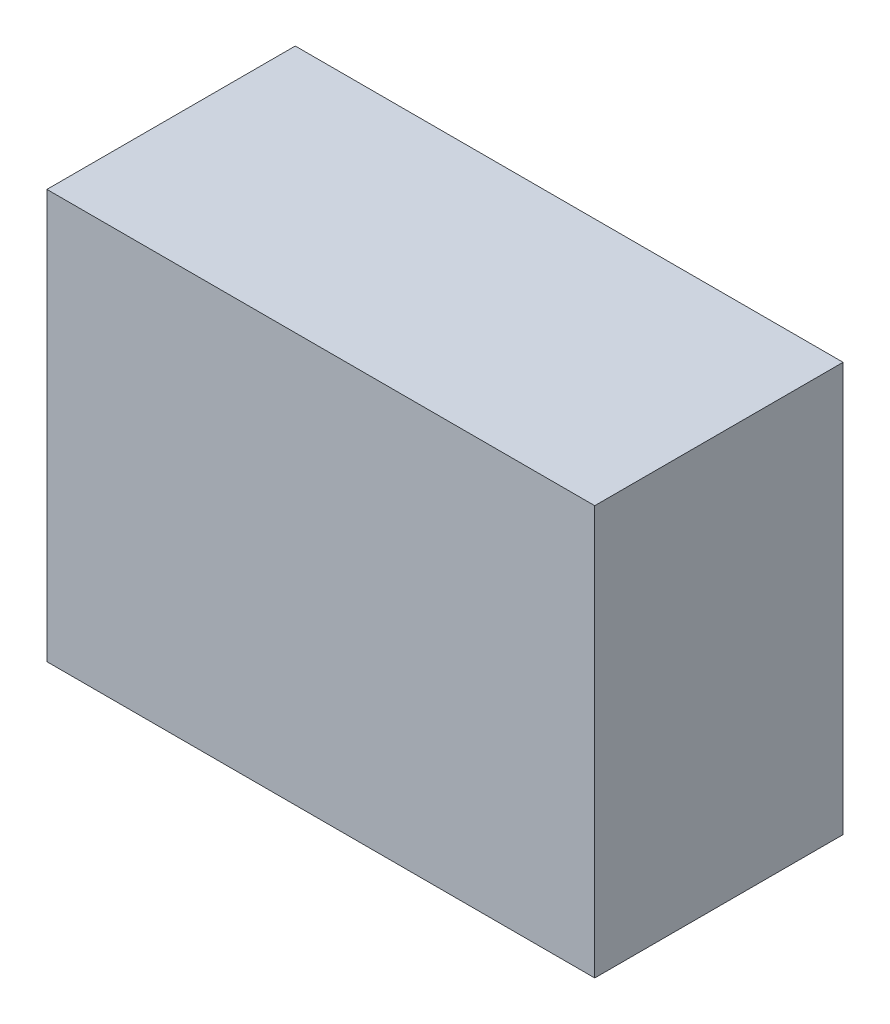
ISO-10303-21;
HEADER;
FILE_DESCRIPTION(('STEP AP214'),'2;1');
FILE_NAME('part.step','',(''),(''),'','','');
FILE_SCHEMA(('AUTOMOTIVE_DESIGN { 1 0 10303 214 1 1 1 1 }'));
ENDSEC;
DATA;
#1=APPLICATION_CONTEXT('core data for automotive mechanical design processes');
#2=APPLICATION_PROTOCOL_DEFINITION('international standard','automotive_design',2000,#1);
#3=PRODUCT_CONTEXT('',#1,'mechanical');
#4=PRODUCT('Part','Part','',(#3));
#5=PRODUCT_RELATED_PRODUCT_CATEGORY('part','',(#4));
#6=PRODUCT_DEFINITION_FORMATION('','',#4);
#7=PRODUCT_DEFINITION_CONTEXT('part definition',#1,'design');
#8=PRODUCT_DEFINITION('design','',#6,#7);
#9=PRODUCT_DEFINITION_SHAPE('','',#8);
#10=(LENGTH_UNIT() NAMED_UNIT(*) SI_UNIT(.MILLI.,.METRE.));
#11=(NAMED_UNIT(*) PLANE_ANGLE_UNIT() SI_UNIT($,.RADIAN.));
#12=(NAMED_UNIT(*) SI_UNIT($,.STERADIAN.) SOLID_ANGLE_UNIT());
#13=UNCERTAINTY_MEASURE_WITH_UNIT(LENGTH_MEASURE(1.E-05),#10,'distance_accuracy_value','');
#14=(GEOMETRIC_REPRESENTATION_CONTEXT(3) GLOBAL_UNCERTAINTY_ASSIGNED_CONTEXT((#13)) GLOBAL_UNIT_ASSIGNED_CONTEXT((#10,
#11,#12)) REPRESENTATION_CONTEXT('',''));
#15=CARTESIAN_POINT('',(0.,0.,0.));
#16=DIRECTION('',(0.,0.,1.));
#17=DIRECTION('',(1.,0.,0.));
#18=AXIS2_PLACEMENT_3D('',#15,#16,#17);
#19=CARTESIAN_POINT('',(47.625,-35.56,43.18));
#20=DIRECTION('',(-1.,0.,0.));
#21=DIRECTION('',(0.,0.,1.));
#22=AXIS2_PLACEMENT_3D('',#19,#20,#21);
#23=PLANE('',#22);
#24=DIRECTION('',(0.,1.,0.));
#25=VECTOR('',#24,1.);
#26=CARTESIAN_POINT('',(47.625,-35.56,0.));
#27=LINE('',#26,#25);
#28=CARTESIAN_POINT('',(47.625,-35.56,0.));
#29=VERTEX_POINT('',#28);
#30=CARTESIAN_POINT('',(47.625,35.56,0.));
#31=VERTEX_POINT('',#30);
#32=EDGE_CURVE('E97',#29,#31,#27,.T.);
#33=ORIENTED_EDGE('',*,*,#32,.T.);
#34=DIRECTION('',(0.,0.,-1.));
#35=VECTOR('',#34,1.);
#36=CARTESIAN_POINT('',(47.625,35.56,43.18));
#37=LINE('',#36,#35);
#38=CARTESIAN_POINT('',(47.625,35.56,43.18));
#39=VERTEX_POINT('',#38);
#40=EDGE_CURVE('E11',#39,#31,#37,.T.);
#41=ORIENTED_EDGE('',*,*,#40,.F.);
#42=DIRECTION('',(0.,1.,0.));
#43=VECTOR('',#42,1.);
#44=CARTESIAN_POINT('',(47.625,-35.56,43.18));
#45=LINE('',#44,#43);
#46=CARTESIAN_POINT('',(47.625,-35.56,43.18));
#47=VERTEX_POINT('',#46);
#48=EDGE_CURVE('E85',#47,#39,#45,.T.);
#49=ORIENTED_EDGE('',*,*,#48,.F.);
#50=DIRECTION('',(0.,0.,-1.));
#51=VECTOR('',#50,1.);
#52=CARTESIAN_POINT('',(47.625,-35.56,43.18));
#53=LINE('',#52,#51);
#54=EDGE_CURVE('E93',#47,#29,#53,.T.);
#55=ORIENTED_EDGE('',*,*,#54,.T.);
#56=EDGE_LOOP('',(#33,#41,#49,#55));
#57=FACE_BOUND('',#56,.T.);
#58=ADVANCED_FACE('F34',(#57),#23,.F.);
#59=CARTESIAN_POINT('',(-47.625,35.56,43.18));
#60=DIRECTION('',(0.,-1.,0.));
#61=DIRECTION('',(0.,0.,-1.));
#62=AXIS2_PLACEMENT_3D('',#59,#60,#61);
#63=PLANE('',#62);
#64=DIRECTION('',(-1.,0.,0.));
#65=VECTOR('',#64,1.);
#66=CARTESIAN_POINT('',(-47.625,35.56,0.));
#67=LINE('',#66,#65);
#68=CARTESIAN_POINT('',(-47.625,35.56,0.));
#69=VERTEX_POINT('',#68);
#70=EDGE_CURVE('E89',#31,#69,#67,.T.);
#71=ORIENTED_EDGE('',*,*,#70,.T.);
#72=DIRECTION('',(0.,0.,-1.));
#73=VECTOR('',#72,1.);
#74=CARTESIAN_POINT('',(-47.625,35.56,43.18));
#75=LINE('',#74,#73);
#76=CARTESIAN_POINT('',(-47.625,35.56,43.18));
#77=VERTEX_POINT('',#76);
#78=EDGE_CURVE('E42',#77,#69,#75,.T.);
#79=ORIENTED_EDGE('',*,*,#78,.F.);
#80=DIRECTION('',(-1.,0.,0.));
#81=VECTOR('',#80,1.);
#82=CARTESIAN_POINT('',(-47.625,35.56,43.18));
#83=LINE('',#82,#81);
#84=EDGE_CURVE('E80',#39,#77,#83,.T.);
#85=ORIENTED_EDGE('',*,*,#84,.F.);
#86=ORIENTED_EDGE('',*,*,#40,.T.);
#87=EDGE_LOOP('',(#71,#79,#85,#86));
#88=FACE_BOUND('',#87,.T.);
#89=ADVANCED_FACE('F88',(#88),#63,.F.);
#90=CARTESIAN_POINT('',(-47.625,-35.56,43.18));
#91=DIRECTION('',(1.,0.,0.));
#92=DIRECTION('',(0.,0.,-1.));
#93=AXIS2_PLACEMENT_3D('',#90,#91,#92);
#94=PLANE('',#93);
#95=DIRECTION('',(0.,-1.,0.));
#96=VECTOR('',#95,1.);
#97=CARTESIAN_POINT('',(-47.625,-35.56,0.));
#98=LINE('',#97,#96);
#99=CARTESIAN_POINT('',(-47.625,-35.56,0.));
#100=VERTEX_POINT('',#99);
#101=EDGE_CURVE('E67',#69,#100,#98,.T.);
#102=ORIENTED_EDGE('',*,*,#101,.T.);
#103=DIRECTION('',(0.,0.,-1.));
#104=VECTOR('',#103,1.);
#105=CARTESIAN_POINT('',(-47.625,-35.56,43.18));
#106=LINE('',#105,#104);
#107=CARTESIAN_POINT('',(-47.625,-35.56,43.18));
#108=VERTEX_POINT('',#107);
#109=EDGE_CURVE('E90',#108,#100,#106,.T.);
#110=ORIENTED_EDGE('',*,*,#109,.F.);
#111=DIRECTION('',(0.,-1.,0.));
#112=VECTOR('',#111,1.);
#113=CARTESIAN_POINT('',(-47.625,-35.56,43.18));
#114=LINE('',#113,#112);
#115=EDGE_CURVE('E83',#77,#108,#114,.T.);
#116=ORIENTED_EDGE('',*,*,#115,.F.);
#117=ORIENTED_EDGE('',*,*,#78,.T.);
#118=EDGE_LOOP('',(#102,#110,#116,#117));
#119=FACE_BOUND('',#118,.T.);
#120=ADVANCED_FACE('F91',(#119),#94,.F.);
#121=CARTESIAN_POINT('',(-47.625,-35.56,43.18));
#122=DIRECTION('',(0.,1.,0.));
#123=DIRECTION('',(0.,0.,1.));
#124=AXIS2_PLACEMENT_3D('',#121,#122,#123);
#125=PLANE('',#124);
#126=DIRECTION('',(1.,0.,0.));
#127=VECTOR('',#126,1.);
#128=CARTESIAN_POINT('',(-47.625,-35.56,0.));
#129=LINE('',#128,#127);
#130=EDGE_CURVE('E73',#100,#29,#129,.T.);
#131=ORIENTED_EDGE('',*,*,#130,.T.);
#132=ORIENTED_EDGE('',*,*,#54,.F.);
#133=DIRECTION('',(1.,0.,0.));
#134=VECTOR('',#133,1.);
#135=CARTESIAN_POINT('',(-47.625,-35.56,43.18));
#136=LINE('',#135,#134);
#137=EDGE_CURVE('E50',#108,#47,#136,.T.);
#138=ORIENTED_EDGE('',*,*,#137,.F.);
#139=ORIENTED_EDGE('',*,*,#109,.T.);
#140=EDGE_LOOP('',(#131,#132,#138,#139));
#141=FACE_BOUND('',#140,.T.);
#142=ADVANCED_FACE('F104',(#141),#125,.F.);
#143=CARTESIAN_POINT('',(0.,0.,43.18));
#144=DIRECTION('',(0.,0.,-1.));
#145=DIRECTION('',(-1.,0.,0.));
#146=AXIS2_PLACEMENT_3D('',#143,#144,#145);
#147=PLANE('',#146);
#148=ORIENTED_EDGE('',*,*,#48,.T.);
#149=ORIENTED_EDGE('',*,*,#84,.T.);
#150=ORIENTED_EDGE('',*,*,#115,.T.);
#151=ORIENTED_EDGE('',*,*,#137,.T.);
#152=EDGE_LOOP('',(#148,#149,#150,#151));
#153=FACE_BOUND('',#152,.T.);
#154=ADVANCED_FACE('F81',(#153),#147,.F.);
#155=CARTESIAN_POINT('',(0.,0.,0.));
#156=DIRECTION('',(0.,0.,-1.));
#157=DIRECTION('',(-1.,0.,0.));
#158=AXIS2_PLACEMENT_3D('',#155,#156,#157);
#159=PLANE('',#158);
#160=ORIENTED_EDGE('',*,*,#32,.F.);
#161=ORIENTED_EDGE('',*,*,#130,.F.);
#162=ORIENTED_EDGE('',*,*,#101,.F.);
#163=ORIENTED_EDGE('',*,*,#70,.F.);
#164=EDGE_LOOP('',(#160,#161,#162,#163));
#165=FACE_BOUND('',#164,.T.);
#166=ADVANCED_FACE('F107',(#165),#159,.T.);
#167=CLOSED_SHELL('',(#58,#89,#120,#142,#154,#166));
#168=MANIFOLD_SOLID_BREP('B2',#167);
#169=ADVANCED_BREP_SHAPE_REPRESENTATION('',(#18,#168),#14);
#170=SHAPE_DEFINITION_REPRESENTATION(#9,#169);
ENDSEC;
END-ISO-10303-21;
